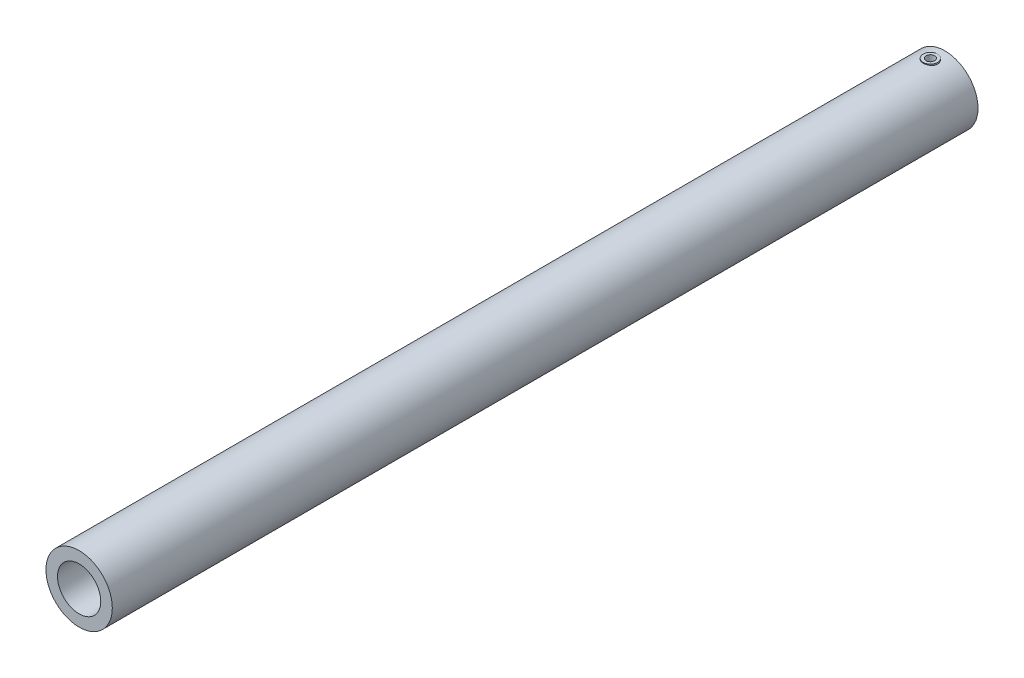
from build123d import *

# Parameters (mm, degrees)
ESQUISSE1_R             = 23
EXTRUSION1_DEPTH        = 600
ESQUISSE3_R             = 15
ENL_V_MAT_EXTRU_1_DEPTH = 90
EXTRUSION2_REACH        = 604.239
EXTRUSION2_END_RADIUS   = 23
ESQUISSE4_R             = 5
EXTRUSION3_REACH        = 604.277
EXTRUSION3_END_RADIUS   = 23
ESQUISSE5_R             = 5
ESQUISSE7_R             = 3
ENL_V_MAT_EXTRU_4_DEPTH = 10
ENL_V_START             = -10
ESQUISSE8_R             = 3
ENL_V_MAT_EXTRU_5_DEPTH = 10


with BuildPart() as part:
    # Esquisse1 → Extrusion1 (new body)
    with BuildSketch(Plane.XY):
        Circle(ESQUISSE1_R)
    extrude(amount=EXTRUSION1_DEPTH)

    # Esquisse3 → Enl_v. mat.-Extru.1 (cut)
    with BuildSketch(Plane.XY.offset(600)):
        Circle(ESQUISSE3_R)
    extrude(amount=-ENL_V_MAT_EXTRU_1_DEPTH, mode=Mode.SUBTRACT)

    # Extrusion2: up to this cylinder (the profile starts outside it)
    extrusion2_end = Plane(origin=(0, 0, 10), z_dir=(0, 0, -1)) * Cylinder(EXTRUSION2_END_RADIUS, 1255.478, mode=Mode.PRIVATE)
    # Esquisse4 → Extrusion2 (add, up to the surface)
    with BuildSketch(Plane(origin=(0, 23.5, 0), x_dir=(-1, 0, 0), z_dir=(0, 1, 0)), mode=Mode.PRIVATE) as extrusion2_sk1:
        with Locations(Location((0, 10, 0), (0, 0, 90))):
            Circle(ESQUISSE4_R)
    extrusion2_tool1 = extrude(extrusion2_sk1.sketch, amount=-EXTRUSION2_REACH, mode=Mode.PRIVATE) - extrusion2_end
    add(extrusion2_tool1.solids().sort_by_distance((0, 23.5, 10))[0])

    # Extrusion3: up to this cylinder (the profile starts outside it)
    extrusion3_end = Plane(origin=(0, 0, 10), z_dir=(0, 0, -1)) * Cylinder(EXTRUSION3_END_RADIUS, 1255.554, mode=Mode.PRIVATE)
    # Esquisse5 → Extrusion3 (add, up to the surface)
    with BuildSketch(Plane(origin=(0, -23.5, 0), x_dir=(-1, 0, 0), z_dir=(0, 1, 0)), mode=Mode.PRIVATE) as extrusion3_sk1:
        with Locations(Location((0, 10, 0), (0, 0, 90))):
            Circle(ESQUISSE5_R)
    extrusion3_tool1 = extrude(extrusion3_sk1.sketch, amount=EXTRUSION3_REACH, mode=Mode.PRIVATE) - extrusion3_end
    add(extrusion3_tool1.solids().sort_by_distance((0, -23.5, 10))[0])

    # Esquisse7 → Enl_v. mat.-Extru.4 (cut)
    with BuildSketch(Plane.XZ.offset(23.5)):
        with Locations(Location((0, 10, 0), (0, 0, 270))):
            Circle(ESQUISSE7_R)
    extrude(amount=-ENL_V_MAT_EXTRU_4_DEPTH, mode=Mode.SUBTRACT)

    # Esquisse8 → Enl_v. mat.-Extru.5 (cut)
    with BuildSketch(Plane(origin=(0, 23.5, 0), x_dir=(-1, 0, 0), z_dir=(0, 1, 0)).offset(ENL_V_START)):
        with Locations(Location((0, 10, 0), (0, 0, 270))):
            Circle(ESQUISSE8_R)
    extrude(amount=ENL_V_MAT_EXTRU_5_DEPTH, mode=Mode.SUBTRACT)


solid = part.part
